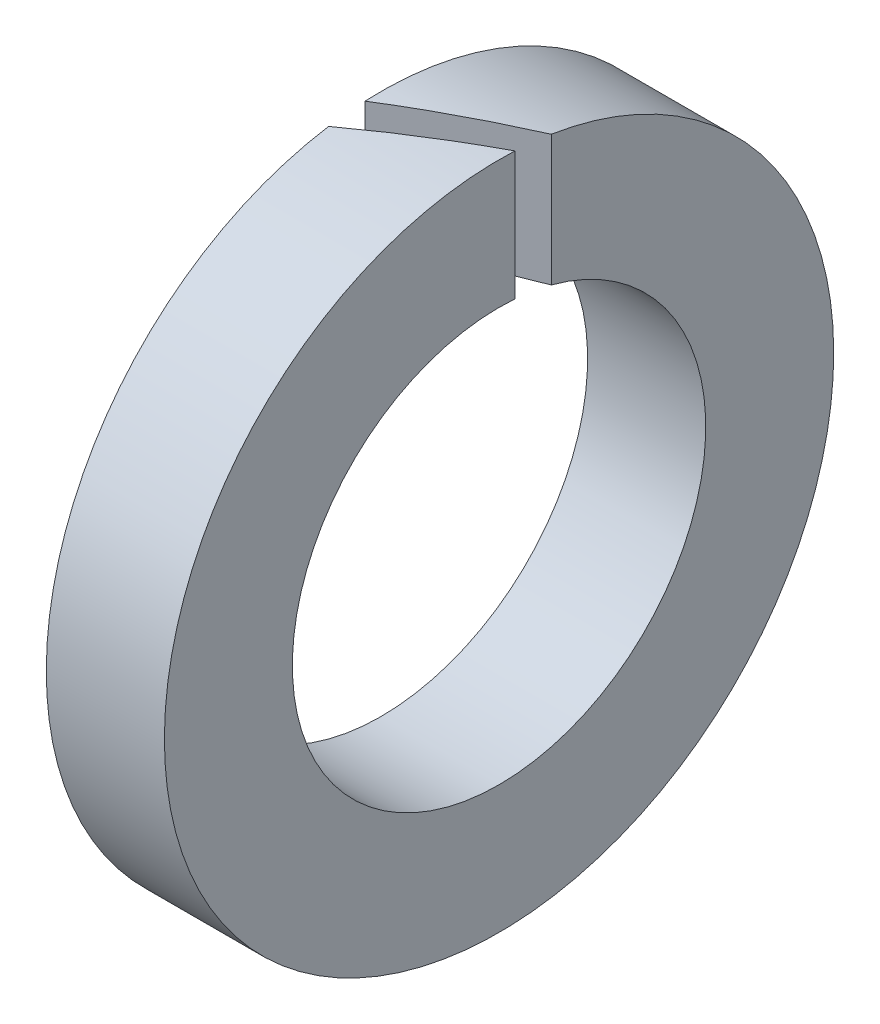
from build123d import *

# Parameters (mm, degrees)
ESQUISSE1_R             = 8.5
ESQUISSE1_R_2           = 5.25
BASE_EXTRUSION_DEPTH    = 3
ENL_V_MAT_EXTRU_1_DEPTH = 13.389511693


with BuildPart() as part:
    # Esquisse1 → Base-Extrusion (new body)
    with BuildSketch(Plane(origin=(0, 0, 0), x_dir=(0, 0, -1), z_dir=(1, 0, 0))):
        Circle(ESQUISSE1_R)
        Circle(ESQUISSE1_R_2, mode=Mode.SUBTRACT)
    extrude(amount=BASE_EXTRUSION_DEPTH)

    # Esquisse2 → Enl_v. mat.-Extru.1 (cut, through all)
    with BuildSketch(Plane(origin=(0, 0, 0), x_dir=(1, 0, 0), z_dir=(0, 1, 0))):
        Polygon((-0.442762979, -0.659774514), (-0.08898076, -1.379281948), (4.016822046, 0.991204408), (3.616820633, 1.684027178), align=None)
    extrude(amount=ENL_V_MAT_EXTRU_1_DEPTH, mode=Mode.SUBTRACT)


solid = part.part
